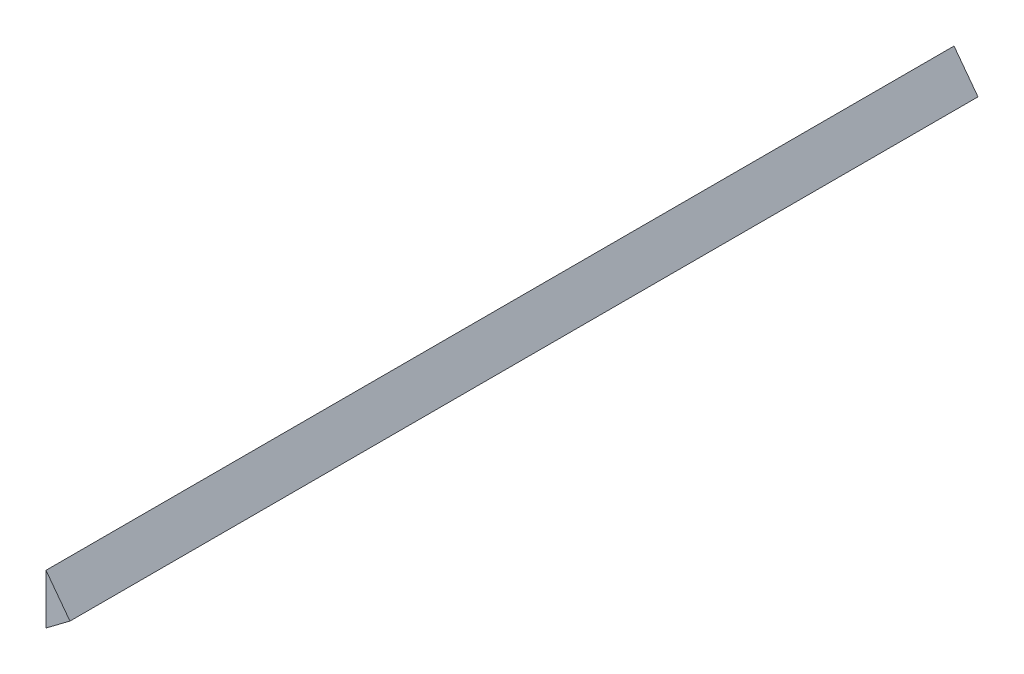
ISO-10303-21;
HEADER;
FILE_DESCRIPTION(('STEP AP214'),'2;1');
FILE_NAME('part.step','',(''),(''),'','','');
FILE_SCHEMA(('AUTOMOTIVE_DESIGN { 1 0 10303 214 1 1 1 1 }'));
ENDSEC;
DATA;
#1=APPLICATION_CONTEXT('core data for automotive mechanical design processes');
#2=APPLICATION_PROTOCOL_DEFINITION('international standard','automotive_design',2000,#1);
#3=PRODUCT_CONTEXT('',#1,'mechanical');
#4=PRODUCT('Part','Part','',(#3));
#5=PRODUCT_RELATED_PRODUCT_CATEGORY('part','',(#4));
#6=PRODUCT_DEFINITION_FORMATION('','',#4);
#7=PRODUCT_DEFINITION_CONTEXT('part definition',#1,'design');
#8=PRODUCT_DEFINITION('design','',#6,#7);
#9=PRODUCT_DEFINITION_SHAPE('','',#8);
#10=(LENGTH_UNIT() NAMED_UNIT(*) SI_UNIT(.MILLI.,.METRE.));
#11=(NAMED_UNIT(*) PLANE_ANGLE_UNIT() SI_UNIT($,.RADIAN.));
#12=(NAMED_UNIT(*) SI_UNIT($,.STERADIAN.) SOLID_ANGLE_UNIT());
#13=UNCERTAINTY_MEASURE_WITH_UNIT(LENGTH_MEASURE(1.E-05),#10,'distance_accuracy_value','');
#14=(GEOMETRIC_REPRESENTATION_CONTEXT(3) GLOBAL_UNCERTAINTY_ASSIGNED_CONTEXT((#13)) GLOBAL_UNIT_ASSIGNED_CONTEXT((#10,
#11,#12)) REPRESENTATION_CONTEXT('',''));
#15=CARTESIAN_POINT('',(0.,0.,0.));
#16=DIRECTION('',(0.,0.,1.));
#17=DIRECTION('',(1.,0.,0.));
#18=AXIS2_PLACEMENT_3D('',#15,#16,#17);
#19=CARTESIAN_POINT('',(-5.87704318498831E-12,-2226.85006790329,-1155.69999999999));
#20=DIRECTION('',(-1.,-1.87849501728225E-13,0.));
#21=DIRECTION('',(1.87849501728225E-13,-1.,0.));
#22=AXIS2_PLACEMENT_3D('',#19,#20,#21);
#23=PLANE('',#22);
#24=DIRECTION('',(1.87849501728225E-13,-1.,0.));
#25=VECTOR('',#24,1.);
#26=CARTESIAN_POINT('',(-5.87704318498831E-12,-2226.85006790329,0.));
#27=LINE('',#26,#25);
#28=CARTESIAN_POINT('',(-5.87704318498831E-12,-2226.85006790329,0.));
#29=VERTEX_POINT('',#28);
#30=CARTESIAN_POINT('',(6.06951438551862E-12,-2290.44649728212,0.));
#31=VERTEX_POINT('',#30);
#32=EDGE_CURVE('E86',#29,#31,#27,.T.);
#33=ORIENTED_EDGE('',*,*,#32,.F.);
#34=DIRECTION('',(0.,0.,1.));
#35=VECTOR('',#34,1.);
#36=CARTESIAN_POINT('',(-5.87704318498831E-12,-2226.85006790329,-1155.69999999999));
#37=LINE('',#36,#35);
#38=CARTESIAN_POINT('',(-5.87704318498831E-12,-2226.85006790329,-1155.69999999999));
#39=VERTEX_POINT('',#38);
#40=EDGE_CURVE('E11',#39,#29,#37,.T.);
#41=ORIENTED_EDGE('',*,*,#40,.F.);
#42=DIRECTION('',(1.87849501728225E-13,-1.,0.));
#43=VECTOR('',#42,1.);
#44=CARTESIAN_POINT('',(-5.87704318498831E-12,-2226.85006790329,-1155.69999999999));
#45=LINE('',#44,#43);
#46=CARTESIAN_POINT('',(6.06951438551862E-12,-2290.44649728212,-1155.69999999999));
#47=VERTEX_POINT('',#46);
#48=EDGE_CURVE('E78',#39,#47,#45,.T.);
#49=ORIENTED_EDGE('',*,*,#48,.T.);
#50=DIRECTION('',(0.,0.,1.));
#51=VECTOR('',#50,1.);
#52=CARTESIAN_POINT('',(6.06951438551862E-12,-2290.44649728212,-1155.69999999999));
#53=LINE('',#52,#51);
#54=EDGE_CURVE('E37',#47,#31,#53,.T.);
#55=ORIENTED_EDGE('',*,*,#54,.T.);
#56=EDGE_LOOP('',(#33,#41,#49,#55));
#57=FACE_BOUND('',#56,.T.);
#58=ADVANCED_FACE('F34',(#57),#23,.T.);
#59=CARTESIAN_POINT('',(30.5059656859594,-2267.62115922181,-1155.69999999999));
#60=DIRECTION('',(0.800681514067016,0.599090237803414,0.));
#61=DIRECTION('',(-0.599090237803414,0.800681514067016,0.));
#62=AXIS2_PLACEMENT_3D('',#59,#60,#61);
#63=PLANE('',#62);
#64=DIRECTION('',(-0.599090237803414,0.800681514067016,0.));
#65=VECTOR('',#64,1.);
#66=CARTESIAN_POINT('',(30.5059656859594,-2267.62115922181,0.));
#67=LINE('',#66,#65);
#68=CARTESIAN_POINT('',(30.5059656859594,-2267.62115922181,0.));
#69=VERTEX_POINT('',#68);
#70=EDGE_CURVE('E80',#69,#29,#67,.T.);
#71=ORIENTED_EDGE('',*,*,#70,.F.);
#72=DIRECTION('',(0.,0.,1.));
#73=VECTOR('',#72,1.);
#74=CARTESIAN_POINT('',(30.5059656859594,-2267.62115922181,-1155.69999999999));
#75=LINE('',#74,#73);
#76=CARTESIAN_POINT('',(30.5059656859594,-2267.62115922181,-1155.69999999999));
#77=VERTEX_POINT('',#76);
#78=EDGE_CURVE('E43',#77,#69,#75,.T.);
#79=ORIENTED_EDGE('',*,*,#78,.F.);
#80=DIRECTION('',(-0.599090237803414,0.800681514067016,0.));
#81=VECTOR('',#80,1.);
#82=CARTESIAN_POINT('',(30.5059656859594,-2267.62115922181,-1155.69999999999));
#83=LINE('',#82,#81);
#84=EDGE_CURVE('E75',#77,#39,#83,.T.);
#85=ORIENTED_EDGE('',*,*,#84,.T.);
#86=ORIENTED_EDGE('',*,*,#40,.T.);
#87=EDGE_LOOP('',(#71,#79,#85,#86));
#88=FACE_BOUND('',#87,.T.);
#89=ADVANCED_FACE('F90',(#88),#63,.T.);
#90=CARTESIAN_POINT('',(6.06951438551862E-12,-2290.44649728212,-1155.69999999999));
#91=DIRECTION('',(0.599090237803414,-0.800681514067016,0.));
#92=DIRECTION('',(0.800681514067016,0.599090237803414,0.));
#93=AXIS2_PLACEMENT_3D('',#90,#91,#92);
#94=PLANE('',#93);
#95=DIRECTION('',(0.800681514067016,0.599090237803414,0.));
#96=VECTOR('',#95,1.);
#97=CARTESIAN_POINT('',(6.06951438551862E-12,-2290.44649728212,0.));
#98=LINE('',#97,#96);
#99=EDGE_CURVE('E73',#31,#69,#98,.T.);
#100=ORIENTED_EDGE('',*,*,#99,.F.);
#101=ORIENTED_EDGE('',*,*,#54,.F.);
#102=DIRECTION('',(0.800681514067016,0.599090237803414,0.));
#103=VECTOR('',#102,1.);
#104=CARTESIAN_POINT('',(6.06951438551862E-12,-2290.44649728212,-1155.69999999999));
#105=LINE('',#104,#103);
#106=EDGE_CURVE('E71',#47,#77,#105,.T.);
#107=ORIENTED_EDGE('',*,*,#106,.T.);
#108=ORIENTED_EDGE('',*,*,#78,.T.);
#109=EDGE_LOOP('',(#100,#101,#107,#108));
#110=FACE_BOUND('',#109,.T.);
#111=ADVANCED_FACE('F70',(#110),#94,.T.);
#112=CARTESIAN_POINT('',(0.,0.,-1155.69999999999));
#113=DIRECTION('',(0.,0.,1.));
#114=DIRECTION('',(1.,0.,0.));
#115=AXIS2_PLACEMENT_3D('',#112,#113,#114);
#116=PLANE('',#115);
#117=ORIENTED_EDGE('',*,*,#48,.F.);
#118=ORIENTED_EDGE('',*,*,#84,.F.);
#119=ORIENTED_EDGE('',*,*,#106,.F.);
#120=EDGE_LOOP('',(#117,#118,#119));
#121=FACE_BOUND('',#120,.T.);
#122=ADVANCED_FACE('F77',(#121),#116,.F.);
#123=CARTESIAN_POINT('',(0.,0.,0.));
#124=DIRECTION('',(0.,0.,1.));
#125=DIRECTION('',(1.,0.,0.));
#126=AXIS2_PLACEMENT_3D('',#123,#124,#125);
#127=PLANE('',#126);
#128=ORIENTED_EDGE('',*,*,#32,.T.);
#129=ORIENTED_EDGE('',*,*,#99,.T.);
#130=ORIENTED_EDGE('',*,*,#70,.T.);
#131=EDGE_LOOP('',(#128,#129,#130));
#132=FACE_BOUND('',#131,.T.);
#133=ADVANCED_FACE('F89',(#132),#127,.T.);
#134=CLOSED_SHELL('',(#58,#89,#111,#122,#133));
#135=MANIFOLD_SOLID_BREP('B2',#134);
#136=ADVANCED_BREP_SHAPE_REPRESENTATION('',(#18,#135),#14);
#137=SHAPE_DEFINITION_REPRESENTATION(#9,#136);
ENDSEC;
END-ISO-10303-21;
